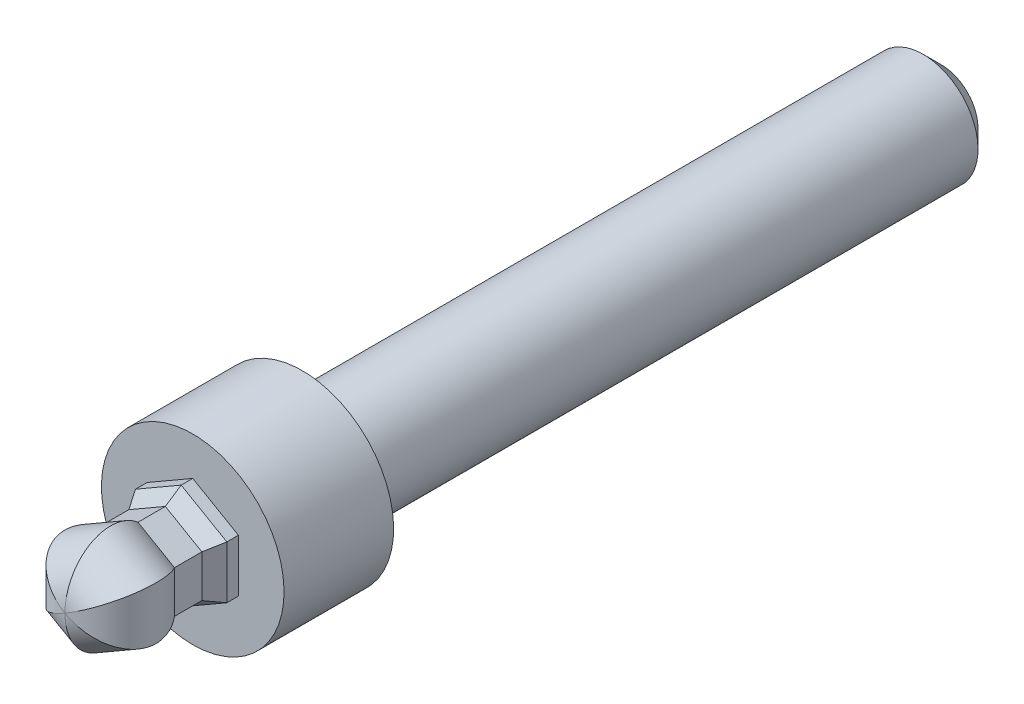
ISO-10303-21;
HEADER;
FILE_DESCRIPTION(('STEP AP214'),'2;1');
FILE_NAME('part.step','',(''),(''),'','','');
FILE_SCHEMA(('AUTOMOTIVE_DESIGN { 1 0 10303 214 1 1 1 1 }'));
ENDSEC;
DATA;
#1=APPLICATION_CONTEXT('core data for automotive mechanical design processes');
#2=APPLICATION_PROTOCOL_DEFINITION('international standard','automotive_design',2000,#1);
#3=PRODUCT_CONTEXT('',#1,'mechanical');
#4=PRODUCT('Part','Part','',(#3));
#5=PRODUCT_RELATED_PRODUCT_CATEGORY('part','',(#4));
#6=PRODUCT_DEFINITION_FORMATION('','',#4);
#7=PRODUCT_DEFINITION_CONTEXT('part definition',#1,'design');
#8=PRODUCT_DEFINITION('design','',#6,#7);
#9=PRODUCT_DEFINITION_SHAPE('','',#8);
#10=(LENGTH_UNIT() NAMED_UNIT(*) SI_UNIT(.MILLI.,.METRE.));
#11=(NAMED_UNIT(*) PLANE_ANGLE_UNIT() SI_UNIT($,.RADIAN.));
#12=(NAMED_UNIT(*) SI_UNIT($,.STERADIAN.) SOLID_ANGLE_UNIT());
#13=UNCERTAINTY_MEASURE_WITH_UNIT(LENGTH_MEASURE(1.E-05),#10,'distance_accuracy_value','');
#14=(GEOMETRIC_REPRESENTATION_CONTEXT(3) GLOBAL_UNCERTAINTY_ASSIGNED_CONTEXT((#13)) GLOBAL_UNIT_ASSIGNED_CONTEXT((#10,
#11,#12)) REPRESENTATION_CONTEXT('',''));
#15=CARTESIAN_POINT('',(0.,0.,0.));
#16=DIRECTION('',(0.,0.,1.));
#17=DIRECTION('',(1.,0.,0.));
#18=AXIS2_PLACEMENT_3D('',#15,#16,#17);
#19=CARTESIAN_POINT('',(0.,0.,-7.));
#20=DIRECTION('',(0.,0.,-1.));
#21=DIRECTION('',(0.,1.,0.));
#22=AXIS2_PLACEMENT_3D('',#19,#20,#21);
#23=PLANE('',#22);
#24=CARTESIAN_POINT('',(0.,0.,-7.));
#25=DIRECTION('',(0.,0.,1.));
#26=DIRECTION('',(0.,-1.,0.));
#27=AXIS2_PLACEMENT_3D('',#24,#25,#26);
#28=CIRCLE('',#27,5.);
#29=CARTESIAN_POINT('',(0.,-5.,-7.));
#30=VERTEX_POINT('',#29);
#31=EDGE_CURVE('E204',#30,#30,#28,.T.);
#32=ORIENTED_EDGE('',*,*,#31,.T.);
#33=EDGE_LOOP('',(#32));
#34=FACE_BOUND('',#33,.T.);
#35=DIRECTION('',(-0.866025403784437,-0.5,0.));
#36=VECTOR('',#35,1.);
#37=CARTESIAN_POINT('',(-1.25,2.16506350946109,-7.));
#38=LINE('',#37,#36);
#39=CARTESIAN_POINT('',(0.,2.88675134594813,-7.));
#40=VERTEX_POINT('',#39);
#41=CARTESIAN_POINT('',(-2.5,1.44337567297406,-7.));
#42=VERTEX_POINT('',#41);
#43=EDGE_CURVE('E29',#40,#42,#38,.T.);
#44=ORIENTED_EDGE('',*,*,#43,.F.);
#45=DIRECTION('',(-0.86602540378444,0.5,0.));
#46=VECTOR('',#45,1.);
#47=CARTESIAN_POINT('',(1.25,2.1650635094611,-7.));
#48=LINE('',#47,#46);
#49=CARTESIAN_POINT('',(2.5,1.44337567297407,-7.));
#50=VERTEX_POINT('',#49);
#51=EDGE_CURVE('E223',#50,#40,#48,.T.);
#52=ORIENTED_EDGE('',*,*,#51,.F.);
#53=DIRECTION('',(0.,1.,0.));
#54=VECTOR('',#53,1.);
#55=CARTESIAN_POINT('',(2.5,0.,-7.));
#56=LINE('',#55,#54);
#57=CARTESIAN_POINT('',(2.5,-1.44337567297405,-7.));
#58=VERTEX_POINT('',#57);
#59=EDGE_CURVE('E37',#58,#50,#56,.T.);
#60=ORIENTED_EDGE('',*,*,#59,.F.);
#61=DIRECTION('',(0.866025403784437,0.5,0.));
#62=VECTOR('',#61,1.);
#63=CARTESIAN_POINT('',(1.25,-2.16506350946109,-7.));
#64=LINE('',#63,#62);
#65=CARTESIAN_POINT('',(0.,-2.88675134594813,-7.));
#66=VERTEX_POINT('',#65);
#67=EDGE_CURVE('E213',#66,#58,#64,.T.);
#68=ORIENTED_EDGE('',*,*,#67,.F.);
#69=DIRECTION('',(0.86602540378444,-0.5,0.));
#70=VECTOR('',#69,1.);
#71=CARTESIAN_POINT('',(-1.25,-2.1650635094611,-7.));
#72=LINE('',#71,#70);
#73=CARTESIAN_POINT('',(-2.5,-1.44337567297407,-7.));
#74=VERTEX_POINT('',#73);
#75=EDGE_CURVE('E216',#74,#66,#72,.T.);
#76=ORIENTED_EDGE('',*,*,#75,.F.);
#77=DIRECTION('',(0.,-1.,0.));
#78=VECTOR('',#77,1.);
#79=CARTESIAN_POINT('',(-2.5,0.,-7.));
#80=LINE('',#79,#78);
#81=EDGE_CURVE('E219',#42,#74,#80,.T.);
#82=ORIENTED_EDGE('',*,*,#81,.F.);
#83=EDGE_LOOP('',(#44,#52,#60,#68,#76,#82));
#84=FACE_BOUND('',#83,.T.);
#85=ADVANCED_FACE('F14',(#34,#84),#23,.F.);
#86=CARTESIAN_POINT('',(-3.,0.,-48.));
#87=DIRECTION('',(0.,0.,1.));
#88=DIRECTION('',(0.,-1.,0.));
#89=AXIS2_PLACEMENT_3D('',#86,#87,#88);
#90=PLANE('',#89);
#91=CARTESIAN_POINT('',(0.,0.,-48.));
#92=DIRECTION('',(0.,0.,1.));
#93=DIRECTION('',(0.,-1.,0.));
#94=AXIS2_PLACEMENT_3D('',#91,#92,#93);
#95=CIRCLE('',#94,2.);
#96=CARTESIAN_POINT('',(0.,-1.99999999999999,-48.));
#97=VERTEX_POINT('',#96);
#98=EDGE_CURVE('E9',#97,#97,#95,.F.);
#99=ORIENTED_EDGE('',*,*,#98,.T.);
#100=EDGE_LOOP('',(#99));
#101=FACE_BOUND('',#100,.T.);
#102=ADVANCED_FACE('F261',(#101),#90,.F.);
#103=CARTESIAN_POINT('',(0.,0.,-7.));
#104=DIRECTION('',(0.,0.,1.));
#105=DIRECTION('',(0.,-1.,0.));
#106=AXIS2_PLACEMENT_3D('',#103,#104,#105);
#107=CYLINDRICAL_SURFACE('',#106,3.);
#108=CARTESIAN_POINT('',(0.,0.,-47.));
#109=DIRECTION('',(0.,0.,1.));
#110=DIRECTION('',(0.,-1.,0.));
#111=AXIS2_PLACEMENT_3D('',#108,#109,#110);
#112=CIRCLE('',#111,3.);
#113=CARTESIAN_POINT('',(0.,-2.99999999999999,-47.));
#114=VERTEX_POINT('',#113);
#115=EDGE_CURVE('E22',#114,#114,#112,.T.);
#116=ORIENTED_EDGE('',*,*,#115,.T.);
#117=EDGE_LOOP('',(#116));
#118=FACE_BOUND('',#117,.T.);
#119=CARTESIAN_POINT('',(0.,0.,-13.));
#120=DIRECTION('',(0.,0.,1.));
#121=DIRECTION('',(0.,-1.,0.));
#122=AXIS2_PLACEMENT_3D('',#119,#120,#121);
#123=CIRCLE('',#122,3.);
#124=CARTESIAN_POINT('',(0.,-3.,-13.));
#125=VERTEX_POINT('',#124);
#126=EDGE_CURVE('E210',#125,#125,#123,.T.);
#127=ORIENTED_EDGE('',*,*,#126,.F.);
#128=EDGE_LOOP('',(#127));
#129=FACE_BOUND('',#128,.T.);
#130=ADVANCED_FACE('F228',(#118,#129),#107,.T.);
#131=CARTESIAN_POINT('',(-5.,0.,-13.));
#132=DIRECTION('',(0.,0.,1.));
#133=DIRECTION('',(0.,-1.,0.));
#134=AXIS2_PLACEMENT_3D('',#131,#132,#133);
#135=PLANE('',#134);
#136=CARTESIAN_POINT('',(0.,0.,-13.));
#137=DIRECTION('',(0.,0.,1.));
#138=DIRECTION('',(0.,-1.,0.));
#139=AXIS2_PLACEMENT_3D('',#136,#137,#138);
#140=CIRCLE('',#139,5.);
#141=CARTESIAN_POINT('',(0.,-5.,-13.));
#142=VERTEX_POINT('',#141);
#143=EDGE_CURVE('E207',#142,#142,#140,.T.);
#144=ORIENTED_EDGE('',*,*,#143,.F.);
#145=EDGE_LOOP('',(#144));
#146=FACE_BOUND('',#145,.T.);
#147=ORIENTED_EDGE('',*,*,#126,.T.);
#148=EDGE_LOOP('',(#147));
#149=FACE_BOUND('',#148,.T.);
#150=ADVANCED_FACE('F244',(#146,#149),#135,.F.);
#151=CARTESIAN_POINT('',(0.,0.,-7.));
#152=DIRECTION('',(0.,0.,1.));
#153=DIRECTION('',(0.,-1.,0.));
#154=AXIS2_PLACEMENT_3D('',#151,#152,#153);
#155=CYLINDRICAL_SURFACE('',#154,5.);
#156=ORIENTED_EDGE('',*,*,#31,.F.);
#157=EDGE_LOOP('',(#156));
#158=FACE_BOUND('',#157,.T.);
#159=ORIENTED_EDGE('',*,*,#143,.T.);
#160=EDGE_LOOP('',(#159));
#161=FACE_BOUND('',#160,.T.);
#162=ADVANCED_FACE('F234',(#158,#161),#155,.T.);
#163=CARTESIAN_POINT('',(0.,-25.,-2.5));
#164=DIRECTION('',(0.,1.,0.));
#165=DIRECTION('',(0.,0.,1.));
#166=AXIS2_PLACEMENT_3D('',#163,#164,#165);
#167=CYLINDRICAL_SURFACE('',#166,2.5);
#168=DIRECTION('',(0.,1.,0.));
#169=VECTOR('',#168,1.);
#170=CARTESIAN_POINT('',(2.,-25.,-4.));
#171=LINE('',#170,#169);
#172=CARTESIAN_POINT('',(2.,-1.15470053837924,-4.));
#173=VERTEX_POINT('',#172);
#174=CARTESIAN_POINT('',(2.,1.15470053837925,-4.));
#175=VERTEX_POINT('',#174);
#176=EDGE_CURVE('E170',#173,#175,#171,.T.);
#177=ORIENTED_EDGE('',*,*,#176,.T.);
#178=CARTESIAN_POINT('',(0.,0.,-2.5));
#179=DIRECTION('',(-0.5,0.866025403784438,0.));
#180=DIRECTION('',(0.866025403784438,0.5,0.));
#181=AXIS2_PLACEMENT_3D('',#178,#179,#180);
#182=ELLIPSE('',#181,2.88675134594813,2.5);
#183=CARTESIAN_POINT('',(0.,0.,0.));
#184=VERTEX_POINT('',#183);
#185=EDGE_CURVE('E191',#175,#184,#182,.F.);
#186=ORIENTED_EDGE('',*,*,#185,.T.);
#187=CARTESIAN_POINT('',(0.,0.,-2.5));
#188=DIRECTION('',(0.5,0.86602540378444,0.));
#189=DIRECTION('',(-0.86602540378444,0.5,0.));
#190=AXIS2_PLACEMENT_3D('',#187,#188,#189);
#191=ELLIPSE('',#190,2.88675134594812,2.5);
#192=EDGE_CURVE('E134',#184,#173,#191,.T.);
#193=ORIENTED_EDGE('',*,*,#192,.T.);
#194=EDGE_LOOP('',(#177,#186,#193));
#195=FACE_BOUND('',#194,.T.);
#196=ADVANCED_FACE('F243',(#195),#167,.T.);
#197=DIRECTION('',(0.,1.,0.));
#198=VECTOR('',#197,1.);
#199=CARTESIAN_POINT('',(-2.,-25.,-4.));
#200=LINE('',#199,#198);
#201=CARTESIAN_POINT('',(-2.,-1.15470053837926,-4.));
#202=VERTEX_POINT('',#201);
#203=CARTESIAN_POINT('',(-2.,1.15470053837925,-4.));
#204=VERTEX_POINT('',#203);
#205=EDGE_CURVE('E169',#202,#204,#200,.T.);
#206=ORIENTED_EDGE('',*,*,#205,.F.);
#207=CARTESIAN_POINT('',(0.,0.,-2.5));
#208=DIRECTION('',(-0.5,0.866025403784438,0.));
#209=DIRECTION('',(0.866025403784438,0.5,0.));
#210=AXIS2_PLACEMENT_3D('',#207,#208,#209);
#211=ELLIPSE('',#210,2.88675134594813,2.5);
#212=EDGE_CURVE('E127',#202,#184,#211,.T.);
#213=ORIENTED_EDGE('',*,*,#212,.T.);
#214=CARTESIAN_POINT('',(0.,0.,-2.5));
#215=DIRECTION('',(0.5,0.86602540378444,0.));
#216=DIRECTION('',(-0.86602540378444,0.5,0.));
#217=AXIS2_PLACEMENT_3D('',#214,#215,#216);
#218=ELLIPSE('',#217,2.88675134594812,2.5);
#219=EDGE_CURVE('E173',#184,#204,#218,.F.);
#220=ORIENTED_EDGE('',*,*,#219,.T.);
#221=EDGE_LOOP('',(#206,#213,#220));
#222=FACE_BOUND('',#221,.T.);
#223=ADVANCED_FACE('F248',(#222),#167,.T.);
#224=CARTESIAN_POINT('',(21.6506350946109,12.5,-2.5));
#225=DIRECTION('',(-0.866025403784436,-0.5,0.));
#226=DIRECTION('',(-0.5,0.866025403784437,0.));
#227=AXIS2_PLACEMENT_3D('',#224,#225,#226);
#228=CYLINDRICAL_SURFACE('',#227,2.5);
#229=CARTESIAN_POINT('',(0.,0.,-2.5));
#230=DIRECTION('',(-1.,0.,0.));
#231=DIRECTION('',(0.,1.,0.));
#232=AXIS2_PLACEMENT_3D('',#229,#230,#231);
#233=ELLIPSE('',#232,2.88675134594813,2.5);
#234=CARTESIAN_POINT('',(0.,2.30940107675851,-4.));
#235=VERTEX_POINT('',#234);
#236=EDGE_CURVE('E136',#235,#184,#233,.F.);
#237=ORIENTED_EDGE('',*,*,#236,.F.);
#238=DIRECTION('',(-0.866025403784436,-0.5,0.));
#239=VECTOR('',#238,1.);
#240=CARTESIAN_POINT('',(20.6506350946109,14.232050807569,-4.));
#241=LINE('',#240,#239);
#242=EDGE_CURVE('E532',#235,#204,#241,.T.);
#243=ORIENTED_EDGE('',*,*,#242,.T.);
#244=ORIENTED_EDGE('',*,*,#219,.F.);
#245=EDGE_LOOP('',(#237,#243,#244));
#246=FACE_BOUND('',#245,.T.);
#247=ADVANCED_FACE('F254',(#246),#228,.T.);
#248=CARTESIAN_POINT('',(21.650635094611,-12.5,-2.5));
#249=DIRECTION('',(-0.86602540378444,0.5,0.));
#250=DIRECTION('',(0.5,0.86602540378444,0.));
#251=AXIS2_PLACEMENT_3D('',#248,#249,#250);
#252=CYLINDRICAL_SURFACE('',#251,2.5);
#253=DIRECTION('',(-0.86602540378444,0.5,0.));
#254=VECTOR('',#253,1.);
#255=CARTESIAN_POINT('',(22.650635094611,-10.7679491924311,-4.));
#256=LINE('',#255,#254);
#257=EDGE_CURVE('E143',#175,#235,#256,.T.);
#258=ORIENTED_EDGE('',*,*,#257,.T.);
#259=ORIENTED_EDGE('',*,*,#236,.T.);
#260=ORIENTED_EDGE('',*,*,#185,.F.);
#261=EDGE_LOOP('',(#258,#259,#260));
#262=FACE_BOUND('',#261,.T.);
#263=ADVANCED_FACE('F310',(#262),#252,.T.);
#264=DIRECTION('',(-0.86602540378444,0.5,0.));
#265=VECTOR('',#264,1.);
#266=CARTESIAN_POINT('',(20.650635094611,-14.2320508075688,-4.));
#267=LINE('',#266,#265);
#268=CARTESIAN_POINT('',(0.,-2.3094010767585,-4.));
#269=VERTEX_POINT('',#268);
#270=EDGE_CURVE('E123',#269,#202,#267,.T.);
#271=ORIENTED_EDGE('',*,*,#270,.F.);
#272=CARTESIAN_POINT('',(0.,0.,-2.5));
#273=DIRECTION('',(-1.,0.,0.));
#274=DIRECTION('',(0.,1.,0.));
#275=AXIS2_PLACEMENT_3D('',#272,#273,#274);
#276=ELLIPSE('',#275,2.88675134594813,2.5);
#277=EDGE_CURVE('E125',#269,#184,#276,.T.);
#278=ORIENTED_EDGE('',*,*,#277,.T.);
#279=ORIENTED_EDGE('',*,*,#212,.F.);
#280=EDGE_LOOP('',(#271,#278,#279));
#281=FACE_BOUND('',#280,.T.);
#282=ADVANCED_FACE('F124',(#281),#252,.T.);
#283=ORIENTED_EDGE('',*,*,#277,.F.);
#284=DIRECTION('',(-0.866025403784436,-0.5,0.));
#285=VECTOR('',#284,1.);
#286=CARTESIAN_POINT('',(22.6506350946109,10.7679491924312,-4.));
#287=LINE('',#286,#285);
#288=EDGE_CURVE('E106',#173,#269,#287,.T.);
#289=ORIENTED_EDGE('',*,*,#288,.F.);
#290=ORIENTED_EDGE('',*,*,#192,.F.);
#291=EDGE_LOOP('',(#283,#289,#290));
#292=FACE_BOUND('',#291,.T.);
#293=ADVANCED_FACE('F133',(#292),#228,.T.);
#294=CARTESIAN_POINT('',(2.,-25.,-4.));
#295=DIRECTION('',(-1.,0.,0.));
#296=DIRECTION('',(0.,0.,1.));
#297=AXIS2_PLACEMENT_3D('',#294,#295,#296);
#298=PLANE('',#297);
#299=DIRECTION('',(0.,1.,0.));
#300=VECTOR('',#299,1.);
#301=CARTESIAN_POINT('',(2.,-25.,-5.5));
#302=LINE('',#301,#300);
#303=CARTESIAN_POINT('',(2.,-1.15470053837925,-5.5));
#304=VERTEX_POINT('',#303);
#305=CARTESIAN_POINT('',(2.,1.15470053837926,-5.5));
#306=VERTEX_POINT('',#305);
#307=EDGE_CURVE('E174',#304,#306,#302,.T.);
#308=ORIENTED_EDGE('',*,*,#307,.T.);
#309=DIRECTION('',(0.,0.,1.));
#310=VECTOR('',#309,1.);
#311=CARTESIAN_POINT('',(2.,1.15470053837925,-4.));
#312=LINE('',#311,#310);
#313=EDGE_CURVE('E154',#306,#175,#312,.T.);
#314=ORIENTED_EDGE('',*,*,#313,.T.);
#315=ORIENTED_EDGE('',*,*,#176,.F.);
#316=DIRECTION('',(0.,0.,-1.));
#317=VECTOR('',#316,1.);
#318=CARTESIAN_POINT('',(2.,-1.15470053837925,-4.));
#319=LINE('',#318,#317);
#320=EDGE_CURVE('E114',#173,#304,#319,.T.);
#321=ORIENTED_EDGE('',*,*,#320,.T.);
#322=EDGE_LOOP('',(#308,#314,#315,#321));
#323=FACE_BOUND('',#322,.T.);
#324=ADVANCED_FACE('F336',(#323),#298,.F.);
#325=CARTESIAN_POINT('',(-2.,-25.,-4.));
#326=DIRECTION('',(1.,0.,0.));
#327=DIRECTION('',(0.,0.,-1.));
#328=AXIS2_PLACEMENT_3D('',#325,#326,#327);
#329=PLANE('',#328);
#330=DIRECTION('',(0.,1.,0.));
#331=VECTOR('',#330,1.);
#332=CARTESIAN_POINT('',(-2.,-25.,-5.5));
#333=LINE('',#332,#331);
#334=CARTESIAN_POINT('',(-2.,-1.15470053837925,-5.5));
#335=VERTEX_POINT('',#334);
#336=CARTESIAN_POINT('',(-2.,1.15470053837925,-5.5));
#337=VERTEX_POINT('',#336);
#338=EDGE_CURVE('E183',#335,#337,#333,.T.);
#339=ORIENTED_EDGE('',*,*,#338,.F.);
#340=DIRECTION('',(0.,0.,1.));
#341=VECTOR('',#340,1.);
#342=CARTESIAN_POINT('',(-2.,-1.15470053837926,-4.));
#343=LINE('',#342,#341);
#344=EDGE_CURVE('E152',#335,#202,#343,.T.);
#345=ORIENTED_EDGE('',*,*,#344,.T.);
#346=ORIENTED_EDGE('',*,*,#205,.T.);
#347=DIRECTION('',(0.,0.,-1.));
#348=VECTOR('',#347,1.);
#349=CARTESIAN_POINT('',(-2.,1.15470053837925,-4.));
#350=LINE('',#349,#348);
#351=EDGE_CURVE('E142',#204,#337,#350,.T.);
#352=ORIENTED_EDGE('',*,*,#351,.T.);
#353=EDGE_LOOP('',(#339,#345,#346,#352));
#354=FACE_BOUND('',#353,.T.);
#355=ADVANCED_FACE('F258',(#354),#329,.F.);
#356=CARTESIAN_POINT('',(20.6506350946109,14.232050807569,-4.));
#357=DIRECTION('',(0.5,-0.866025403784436,0.));
#358=DIRECTION('',(-0.866025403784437,-0.5,0.));
#359=AXIS2_PLACEMENT_3D('',#356,#357,#358);
#360=PLANE('',#359);
#361=ORIENTED_EDGE('',*,*,#242,.F.);
#362=DIRECTION('',(0.,0.,1.));
#363=VECTOR('',#362,1.);
#364=CARTESIAN_POINT('',(0.,2.30940107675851,-4.));
#365=LINE('',#364,#363);
#366=CARTESIAN_POINT('',(0.,2.3094010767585,-5.5));
#367=VERTEX_POINT('',#366);
#368=EDGE_CURVE('E137',#367,#235,#365,.T.);
#369=ORIENTED_EDGE('',*,*,#368,.F.);
#370=DIRECTION('',(-0.866025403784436,-0.5,0.));
#371=VECTOR('',#370,1.);
#372=CARTESIAN_POINT('',(20.6506350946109,14.232050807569,-5.5));
#373=LINE('',#372,#371);
#374=EDGE_CURVE('E523',#367,#337,#373,.T.);
#375=ORIENTED_EDGE('',*,*,#374,.T.);
#376=ORIENTED_EDGE('',*,*,#351,.F.);
#377=EDGE_LOOP('',(#361,#369,#375,#376));
#378=FACE_BOUND('',#377,.T.);
#379=ADVANCED_FACE('F353',(#378),#360,.F.);
#380=CARTESIAN_POINT('',(22.650635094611,-10.7679491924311,-4.));
#381=DIRECTION('',(-0.5,-0.86602540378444,0.));
#382=DIRECTION('',(-0.86602540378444,0.5,0.));
#383=AXIS2_PLACEMENT_3D('',#380,#381,#382);
#384=PLANE('',#383);
#385=DIRECTION('',(-0.86602540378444,0.5,0.));
#386=VECTOR('',#385,1.);
#387=CARTESIAN_POINT('',(22.650635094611,-10.7679491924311,-5.5));
#388=LINE('',#387,#386);
#389=EDGE_CURVE('E147',#306,#367,#388,.T.);
#390=ORIENTED_EDGE('',*,*,#389,.T.);
#391=ORIENTED_EDGE('',*,*,#368,.T.);
#392=ORIENTED_EDGE('',*,*,#257,.F.);
#393=ORIENTED_EDGE('',*,*,#313,.F.);
#394=EDGE_LOOP('',(#390,#391,#392,#393));
#395=FACE_BOUND('',#394,.T.);
#396=ADVANCED_FACE('F362',(#395),#384,.F.);
#397=CARTESIAN_POINT('',(20.650635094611,-14.2320508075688,-4.));
#398=DIRECTION('',(0.5,0.86602540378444,0.));
#399=DIRECTION('',(0.86602540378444,-0.5,0.));
#400=AXIS2_PLACEMENT_3D('',#397,#398,#399);
#401=PLANE('',#400);
#402=DIRECTION('',(-0.86602540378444,0.5,0.));
#403=VECTOR('',#402,1.);
#404=CARTESIAN_POINT('',(20.650635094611,-14.2320508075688,-5.5));
#405=LINE('',#404,#403);
#406=CARTESIAN_POINT('',(0.,-2.30940107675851,-5.5));
#407=VERTEX_POINT('',#406);
#408=EDGE_CURVE('E130',#407,#335,#405,.T.);
#409=ORIENTED_EDGE('',*,*,#408,.F.);
#410=DIRECTION('',(0.,0.,1.));
#411=VECTOR('',#410,1.);
#412=CARTESIAN_POINT('',(0.,-2.30940107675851,-4.));
#413=LINE('',#412,#411);
#414=EDGE_CURVE('E111',#407,#269,#413,.T.);
#415=ORIENTED_EDGE('',*,*,#414,.T.);
#416=ORIENTED_EDGE('',*,*,#270,.T.);
#417=ORIENTED_EDGE('',*,*,#344,.F.);
#418=EDGE_LOOP('',(#409,#415,#416,#417));
#419=FACE_BOUND('',#418,.T.);
#420=ADVANCED_FACE('F139',(#419),#401,.F.);
#421=CARTESIAN_POINT('',(22.6506350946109,10.7679491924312,-4.));
#422=DIRECTION('',(-0.5,0.866025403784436,0.));
#423=DIRECTION('',(0.866025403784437,0.5,0.));
#424=AXIS2_PLACEMENT_3D('',#421,#422,#423);
#425=PLANE('',#424);
#426=ORIENTED_EDGE('',*,*,#288,.T.);
#427=ORIENTED_EDGE('',*,*,#414,.F.);
#428=DIRECTION('',(-0.866025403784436,-0.5,0.));
#429=VECTOR('',#428,1.);
#430=CARTESIAN_POINT('',(22.6506350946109,10.7679491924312,-5.5));
#431=LINE('',#430,#429);
#432=EDGE_CURVE('E119',#304,#407,#431,.T.);
#433=ORIENTED_EDGE('',*,*,#432,.F.);
#434=ORIENTED_EDGE('',*,*,#320,.F.);
#435=EDGE_LOOP('',(#426,#427,#433,#434));
#436=FACE_BOUND('',#435,.T.);
#437=ADVANCED_FACE('F108',(#436),#425,.F.);
#438=CARTESIAN_POINT('',(2.,-25.,-5.5));
#439=DIRECTION('',(-0.866025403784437,0.,-0.5));
#440=DIRECTION('',(-0.5,0.,0.866025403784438));
#441=AXIS2_PLACEMENT_3D('',#438,#439,#440);
#442=PLANE('',#441);
#443=DIRECTION('',(0.,1.,0.));
#444=VECTOR('',#443,1.);
#445=CARTESIAN_POINT('',(2.5,-25.,-6.36602540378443));
#446=LINE('',#445,#444);
#447=CARTESIAN_POINT('',(2.5,-1.44337567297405,-6.36602540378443));
#448=VERTEX_POINT('',#447);
#449=CARTESIAN_POINT('',(2.5,1.44337567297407,-6.36602540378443));
#450=VERTEX_POINT('',#449);
#451=EDGE_CURVE('E177',#448,#450,#446,.T.);
#452=ORIENTED_EDGE('',*,*,#451,.T.);
#453=DIRECTION('',(-0.480384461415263,-0.277350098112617,0.832050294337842));
#454=VECTOR('',#453,1.);
#455=CARTESIAN_POINT('',(-1.48471309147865,-0.857199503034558,0.535700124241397));
#456=LINE('',#455,#454);
#457=EDGE_CURVE('E166',#450,#306,#456,.T.);
#458=ORIENTED_EDGE('',*,*,#457,.T.);
#459=ORIENTED_EDGE('',*,*,#307,.F.);
#460=DIRECTION('',(0.480384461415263,-0.277350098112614,-0.832050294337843));
#461=VECTOR('',#460,1.);
#462=CARTESIAN_POINT('',(5.17702078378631,-2.98895434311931,-11.0027614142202));
#463=LINE('',#462,#461);
#464=EDGE_CURVE('E163',#304,#448,#463,.T.);
#465=ORIENTED_EDGE('',*,*,#464,.T.);
#466=EDGE_LOOP('',(#452,#458,#459,#465));
#467=FACE_BOUND('',#466,.T.);
#468=ADVANCED_FACE('F389',(#467),#442,.F.);
#469=CARTESIAN_POINT('',(-2.,-25.,-5.5));
#470=DIRECTION('',(0.866025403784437,0.,-0.5));
#471=DIRECTION('',(-0.5,0.,-0.866025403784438));
#472=AXIS2_PLACEMENT_3D('',#469,#470,#471);
#473=PLANE('',#472);
#474=DIRECTION('',(0.,1.,0.));
#475=VECTOR('',#474,1.);
#476=CARTESIAN_POINT('',(-2.5,-25.,-6.36602540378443));
#477=LINE('',#476,#475);
#478=CARTESIAN_POINT('',(-2.5,-1.44337567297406,-6.36602540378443));
#479=VERTEX_POINT('',#478);
#480=CARTESIAN_POINT('',(-2.5,1.44337567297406,-6.36602540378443));
#481=VERTEX_POINT('',#480);
#482=EDGE_CURVE('E180',#479,#481,#477,.T.);
#483=ORIENTED_EDGE('',*,*,#482,.F.);
#484=DIRECTION('',(0.480384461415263,0.277350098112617,0.832050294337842));
#485=VECTOR('',#484,1.);
#486=CARTESIAN_POINT('',(-5.17702078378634,-2.98895434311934,-11.0027614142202));
#487=LINE('',#486,#485);
#488=EDGE_CURVE('E160',#479,#335,#487,.T.);
#489=ORIENTED_EDGE('',*,*,#488,.T.);
#490=ORIENTED_EDGE('',*,*,#338,.T.);
#491=DIRECTION('',(-0.480384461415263,0.277350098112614,-0.832050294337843));
#492=VECTOR('',#491,1.);
#493=CARTESIAN_POINT('',(1.48471309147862,-0.857199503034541,0.535700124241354));
#494=LINE('',#493,#492);
#495=EDGE_CURVE('E157',#337,#481,#494,.T.);
#496=ORIENTED_EDGE('',*,*,#495,.T.);
#497=EDGE_LOOP('',(#483,#489,#490,#496));
#498=FACE_BOUND('',#497,.T.);
#499=ADVANCED_FACE('F398',(#498),#473,.F.);
#500=CARTESIAN_POINT('',(20.6506350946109,14.232050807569,-5.5));
#501=DIRECTION('',(0.433012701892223,-0.75,-0.5));
#502=DIRECTION('',(0.,0.554700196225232,-0.832050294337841));
#503=AXIS2_PLACEMENT_3D('',#500,#501,#502);
#504=PLANE('',#503);
#505=ORIENTED_EDGE('',*,*,#374,.F.);
#506=DIRECTION('',(0.,-0.554700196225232,0.832050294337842));
#507=VECTOR('',#506,1.);
#508=CARTESIAN_POINT('',(0.,-1.71439900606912,0.535700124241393));
#509=LINE('',#508,#507);
#510=CARTESIAN_POINT('',(0.,2.88675134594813,-6.36602540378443));
#511=VERTEX_POINT('',#510);
#512=EDGE_CURVE('E522',#511,#367,#509,.T.);
#513=ORIENTED_EDGE('',*,*,#512,.F.);
#514=DIRECTION('',(-0.866025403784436,-0.5,0.));
#515=VECTOR('',#514,1.);
#516=CARTESIAN_POINT('',(20.4006350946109,14.6650635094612,-6.36602540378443));
#517=LINE('',#516,#515);
#518=EDGE_CURVE('E517',#511,#481,#517,.T.);
#519=ORIENTED_EDGE('',*,*,#518,.T.);
#520=ORIENTED_EDGE('',*,*,#495,.F.);
#521=EDGE_LOOP('',(#505,#513,#519,#520));
#522=FACE_BOUND('',#521,.T.);
#523=ADVANCED_FACE('F408',(#522),#504,.F.);
#524=CARTESIAN_POINT('',(22.650635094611,-10.7679491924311,-5.5));
#525=DIRECTION('',(-0.433012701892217,-0.75,-0.5));
#526=DIRECTION('',(0.,0.554700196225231,-0.832050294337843));
#527=AXIS2_PLACEMENT_3D('',#524,#525,#526);
#528=PLANE('',#527);
#529=DIRECTION('',(-0.86602540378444,0.5,0.));
#530=VECTOR('',#529,1.);
#531=CARTESIAN_POINT('',(22.900635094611,-10.3349364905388,-6.36602540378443));
#532=LINE('',#531,#530);
#533=EDGE_CURVE('E544',#450,#511,#532,.T.);
#534=ORIENTED_EDGE('',*,*,#533,.T.);
#535=ORIENTED_EDGE('',*,*,#512,.T.);
#536=ORIENTED_EDGE('',*,*,#389,.F.);
#537=ORIENTED_EDGE('',*,*,#457,.F.);
#538=EDGE_LOOP('',(#534,#535,#536,#537));
#539=FACE_BOUND('',#538,.T.);
#540=ADVANCED_FACE('F417',(#539),#528,.F.);
#541=CARTESIAN_POINT('',(20.650635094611,-14.2320508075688,-5.5));
#542=DIRECTION('',(0.433012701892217,0.75,-0.5));
#543=DIRECTION('',(0.,0.554700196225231,0.832050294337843));
#544=AXIS2_PLACEMENT_3D('',#541,#542,#543);
#545=PLANE('',#544);
#546=DIRECTION('',(-0.86602540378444,0.5,0.));
#547=VECTOR('',#546,1.);
#548=CARTESIAN_POINT('',(20.400635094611,-14.665063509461,-6.36602540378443));
#549=LINE('',#548,#547);
#550=CARTESIAN_POINT('',(0.,-2.88675134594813,-6.36602540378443));
#551=VERTEX_POINT('',#550);
#552=EDGE_CURVE('E547',#551,#479,#549,.T.);
#553=ORIENTED_EDGE('',*,*,#552,.F.);
#554=DIRECTION('',(0.,0.554700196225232,0.832050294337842));
#555=VECTOR('',#554,1.);
#556=CARTESIAN_POINT('',(0.,-5.97790868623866,-11.0027614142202));
#557=LINE('',#556,#555);
#558=EDGE_CURVE('E551',#551,#407,#557,.T.);
#559=ORIENTED_EDGE('',*,*,#558,.T.);
#560=ORIENTED_EDGE('',*,*,#408,.T.);
#561=ORIENTED_EDGE('',*,*,#488,.F.);
#562=EDGE_LOOP('',(#553,#559,#560,#561));
#563=FACE_BOUND('',#562,.T.);
#564=ADVANCED_FACE('F427',(#563),#545,.F.);
#565=CARTESIAN_POINT('',(22.6506350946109,10.7679491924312,-5.5));
#566=DIRECTION('',(-0.433012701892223,0.75,-0.5));
#567=DIRECTION('',(0.,0.554700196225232,0.832050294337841));
#568=AXIS2_PLACEMENT_3D('',#565,#566,#567);
#569=PLANE('',#568);
#570=ORIENTED_EDGE('',*,*,#432,.T.);
#571=ORIENTED_EDGE('',*,*,#558,.F.);
#572=DIRECTION('',(-0.866025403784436,-0.5,0.));
#573=VECTOR('',#572,1.);
#574=CARTESIAN_POINT('',(22.9006350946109,10.334936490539,-6.36602540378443));
#575=LINE('',#574,#573);
#576=EDGE_CURVE('E524',#448,#551,#575,.T.);
#577=ORIENTED_EDGE('',*,*,#576,.F.);
#578=ORIENTED_EDGE('',*,*,#464,.F.);
#579=EDGE_LOOP('',(#570,#571,#577,#578));
#580=FACE_BOUND('',#579,.T.);
#581=ADVANCED_FACE('F437',(#580),#569,.F.);
#582=CARTESIAN_POINT('',(22.9006350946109,10.334936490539,-6.36602540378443));
#583=DIRECTION('',(-0.5,0.866025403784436,0.));
#584=DIRECTION('',(0.866025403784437,0.5,0.));
#585=AXIS2_PLACEMENT_3D('',#582,#583,#584);
#586=PLANE('',#585);
#587=DIRECTION('',(0.,0.,1.));
#588=VECTOR('',#587,1.);
#589=CARTESIAN_POINT('',(0.,-2.88675134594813,-6.36602540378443));
#590=LINE('',#589,#588);
#591=EDGE_CURVE('E537',#66,#551,#590,.T.);
#592=ORIENTED_EDGE('',*,*,#591,.F.);
#593=ORIENTED_EDGE('',*,*,#67,.T.);
#594=DIRECTION('',(0.,0.,-1.));
#595=VECTOR('',#594,1.);
#596=CARTESIAN_POINT('',(2.5,-1.44337567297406,-6.36602540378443));
#597=LINE('',#596,#595);
#598=EDGE_CURVE('E200',#448,#58,#597,.T.);
#599=ORIENTED_EDGE('',*,*,#598,.F.);
#600=ORIENTED_EDGE('',*,*,#576,.T.);
#601=EDGE_LOOP('',(#592,#593,#599,#600));
#602=FACE_BOUND('',#601,.T.);
#603=ADVANCED_FACE('F447',(#602),#586,.F.);
#604=CARTESIAN_POINT('',(20.400635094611,-14.665063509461,-6.36602540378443));
#605=DIRECTION('',(0.5,0.86602540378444,0.));
#606=DIRECTION('',(0.86602540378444,-0.5,0.));
#607=AXIS2_PLACEMENT_3D('',#604,#605,#606);
#608=PLANE('',#607);
#609=DIRECTION('',(0.,0.,1.));
#610=VECTOR('',#609,1.);
#611=CARTESIAN_POINT('',(-2.5,-1.44337567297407,-6.36602540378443));
#612=LINE('',#611,#610);
#613=EDGE_CURVE('E198',#74,#479,#612,.T.);
#614=ORIENTED_EDGE('',*,*,#613,.F.);
#615=ORIENTED_EDGE('',*,*,#75,.T.);
#616=ORIENTED_EDGE('',*,*,#591,.T.);
#617=ORIENTED_EDGE('',*,*,#552,.T.);
#618=EDGE_LOOP('',(#614,#615,#616,#617));
#619=FACE_BOUND('',#618,.T.);
#620=ADVANCED_FACE('F457',(#619),#608,.F.);
#621=CARTESIAN_POINT('',(22.900635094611,-10.3349364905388,-6.36602540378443));
#622=DIRECTION('',(-0.5,-0.86602540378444,0.));
#623=DIRECTION('',(-0.86602540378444,0.5,0.));
#624=AXIS2_PLACEMENT_3D('',#621,#622,#623);
#625=PLANE('',#624);
#626=DIRECTION('',(0.,0.,1.));
#627=VECTOR('',#626,1.);
#628=CARTESIAN_POINT('',(2.5,1.44337567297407,-6.36602540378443));
#629=LINE('',#628,#627);
#630=EDGE_CURVE('E202',#50,#450,#629,.T.);
#631=ORIENTED_EDGE('',*,*,#630,.F.);
#632=ORIENTED_EDGE('',*,*,#51,.T.);
#633=DIRECTION('',(0.,0.,1.));
#634=VECTOR('',#633,1.);
#635=CARTESIAN_POINT('',(0.,2.88675134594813,-6.36602540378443));
#636=LINE('',#635,#634);
#637=EDGE_CURVE('E131',#40,#511,#636,.T.);
#638=ORIENTED_EDGE('',*,*,#637,.T.);
#639=ORIENTED_EDGE('',*,*,#533,.F.);
#640=EDGE_LOOP('',(#631,#632,#638,#639));
#641=FACE_BOUND('',#640,.T.);
#642=ADVANCED_FACE('F467',(#641),#625,.F.);
#643=CARTESIAN_POINT('',(20.4006350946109,14.6650635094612,-6.36602540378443));
#644=DIRECTION('',(0.5,-0.866025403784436,0.));
#645=DIRECTION('',(-0.866025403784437,-0.5,0.));
#646=AXIS2_PLACEMENT_3D('',#643,#644,#645);
#647=PLANE('',#646);
#648=ORIENTED_EDGE('',*,*,#637,.F.);
#649=ORIENTED_EDGE('',*,*,#43,.T.);
#650=DIRECTION('',(0.,0.,-1.));
#651=VECTOR('',#650,1.);
#652=CARTESIAN_POINT('',(-2.5,1.44337567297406,-6.36602540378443));
#653=LINE('',#652,#651);
#654=EDGE_CURVE('E195',#481,#42,#653,.T.);
#655=ORIENTED_EDGE('',*,*,#654,.F.);
#656=ORIENTED_EDGE('',*,*,#518,.F.);
#657=EDGE_LOOP('',(#648,#649,#655,#656));
#658=FACE_BOUND('',#657,.T.);
#659=ADVANCED_FACE('F477',(#658),#647,.F.);
#660=CARTESIAN_POINT('',(-2.5,-25.,-6.36602540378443));
#661=DIRECTION('',(1.,0.,0.));
#662=DIRECTION('',(0.,0.,-1.));
#663=AXIS2_PLACEMENT_3D('',#660,#661,#662);
#664=PLANE('',#663);
#665=ORIENTED_EDGE('',*,*,#654,.T.);
#666=ORIENTED_EDGE('',*,*,#81,.T.);
#667=ORIENTED_EDGE('',*,*,#613,.T.);
#668=ORIENTED_EDGE('',*,*,#482,.T.);
#669=EDGE_LOOP('',(#665,#666,#667,#668));
#670=FACE_BOUND('',#669,.T.);
#671=ADVANCED_FACE('F239',(#670),#664,.F.);
#672=CARTESIAN_POINT('',(2.5,-25.,-6.36602540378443));
#673=DIRECTION('',(-1.,0.,0.));
#674=DIRECTION('',(0.,0.,1.));
#675=AXIS2_PLACEMENT_3D('',#672,#673,#674);
#676=PLANE('',#675);
#677=ORIENTED_EDGE('',*,*,#598,.T.);
#678=ORIENTED_EDGE('',*,*,#59,.T.);
#679=ORIENTED_EDGE('',*,*,#630,.T.);
#680=ORIENTED_EDGE('',*,*,#451,.F.);
#681=EDGE_LOOP('',(#677,#678,#679,#680));
#682=FACE_BOUND('',#681,.T.);
#683=ADVANCED_FACE('F232',(#682),#676,.F.);
#684=CARTESIAN_POINT('',(0.,0.,-47.));
#685=DIRECTION('',(0.,0.,1.));
#686=DIRECTION('',(0.,-1.,0.));
#687=AXIS2_PLACEMENT_3D('',#684,#685,#686);
#688=CONICAL_SURFACE('',#687,3.,0.785398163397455);
#689=ORIENTED_EDGE('',*,*,#98,.F.);
#690=EDGE_LOOP('',(#689));
#691=FACE_BOUND('',#690,.T.);
#692=ORIENTED_EDGE('',*,*,#115,.F.);
#693=EDGE_LOOP('',(#692));
#694=FACE_BOUND('',#693,.T.);
#695=ADVANCED_FACE('F16',(#691,#694),#688,.T.);
#696=CLOSED_SHELL('',(#85,#102,#130,#150,#162,#196,#223,#247,#263,#282,#293,#324,#355,#379,#396,
#420,#437,#468,#499,#523,#540,#564,#581,#603,#620,#642,#659,#671,#683,#695));
#697=MANIFOLD_SOLID_BREP('B1',#696);
#698=ADVANCED_BREP_SHAPE_REPRESENTATION('',(#18,#697),#14);
#699=SHAPE_DEFINITION_REPRESENTATION(#9,#698);
ENDSEC;
END-ISO-10303-21;
